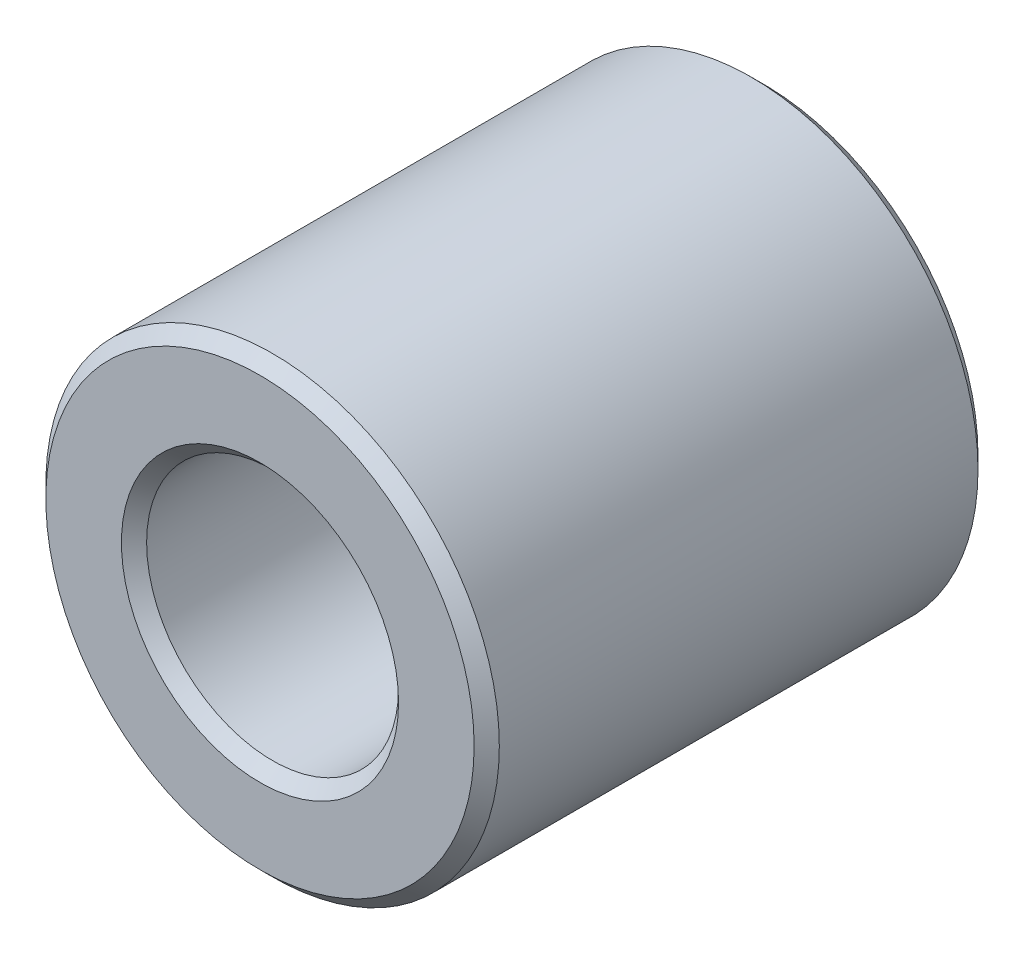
from build123d import *

# Parameters (mm, degrees)
SKETCH1_R           = 45
SKETCH1_R_2         = 25
BOSS_EXTRUDE1_DEPTH = 50
CHAMFER1_SIZE       = 2.5


with BuildPart() as part:
    # Sketch1 → Boss-Extrude1 (new, symmetric)
    with BuildSketch(Plane.XY):
        Circle(SKETCH1_R)
        Circle(SKETCH1_R_2, mode=Mode.SUBTRACT)
    extrude(amount=BOSS_EXTRUDE1_DEPTH, both=True)

    # Chamfer1
    chamfer1_edges = [part.edges().sort_by_distance(p)[0] for p in [
        (-45, 0, -50),
        (-45, 0, 50),
        (-25, 0, -50),
        (-25, 0, 50),
    ]]
    chamfer(chamfer1_edges, length=CHAMFER1_SIZE)


solid = part.part
